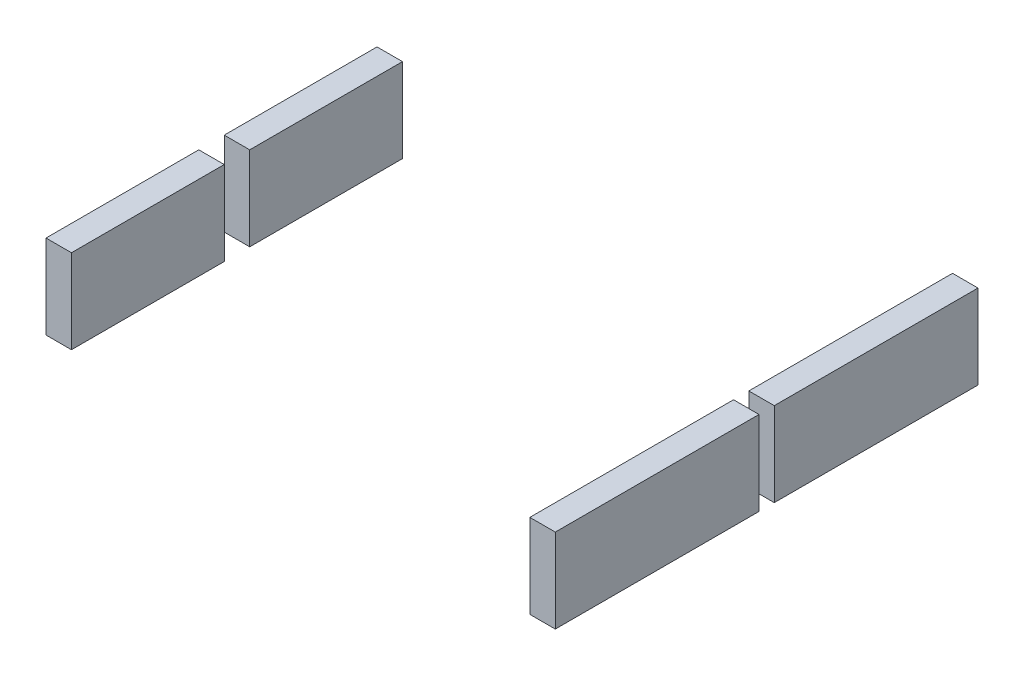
from build123d import *

# Parameters (mm, degrees)
SKETCH1_W             = 2.54
SKETCH1_H             = 20.32
BOSS_EXTRUDE1_DEPTH   = 8.382
BOSS_EXTRUDE1_2_DEPTH = 8.382
SKETCH1_H_2           = 15.24
BOSS_EXTRUDE1_3_DEPTH = 8.382
BOSS_EXTRUDE1_4_DEPTH = 8.382


with BuildPart() as part:
    # Sketch1 → Boss-Extrude1 (new body)
    with BuildSketch(Plane(origin=(0, 0, 0), x_dir=(1, 0, 0), z_dir=(0, 1, 0))):
        with Locations((-1.27, 10.16)):
            Rectangle(SKETCH1_W, SKETCH1_H)
    extrude(amount=BOSS_EXTRUDE1_DEPTH)


with BuildPart() as body_2:
    # Sketch1 → Boss-Extrude1 2 (new body)
    with BuildSketch(Plane(origin=(0, 0, 0), x_dir=(1, 0, 0), z_dir=(0, 1, 0))):
        with Locations((-1.27, 32.004)):
            Rectangle(SKETCH1_W, SKETCH1_H)
    extrude(amount=BOSS_EXTRUDE1_2_DEPTH)


with BuildPart() as body_3:
    # Sketch1 → Boss-Extrude1 3 (new body)
    with BuildSketch(Plane(origin=(0, 0, 0), x_dir=(1, 0, 0), z_dir=(0, 1, 0))):
        with Locations((-49.53, 7.62)):
            Rectangle(SKETCH1_W, SKETCH1_H_2)
    extrude(amount=BOSS_EXTRUDE1_3_DEPTH)


with BuildPart() as body_4:
    # Sketch1 → Boss-Extrude1 4 (new body)
    with BuildSketch(Plane(origin=(0, 0, 0), x_dir=(1, 0, 0), z_dir=(0, 1, 0))):
        with Locations((-49.53, 25.4)):
            Rectangle(SKETCH1_W, SKETCH1_H_2)
    extrude(amount=BOSS_EXTRUDE1_4_DEPTH)


solid = Compound([part.part, body_2.part, body_3.part, body_4.part])
